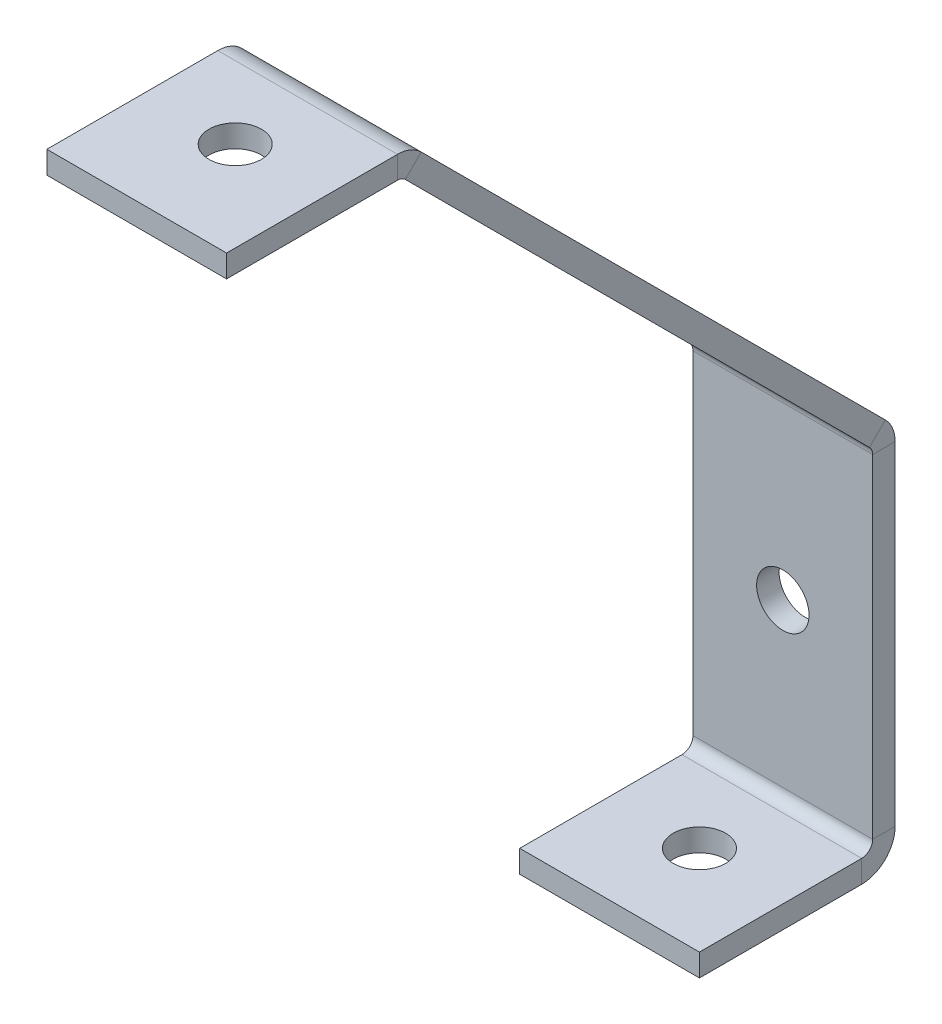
ISO-10303-21;
HEADER;
FILE_DESCRIPTION(('STEP AP214'),'2;1');
FILE_NAME('part.step','',(''),(''),'','','');
FILE_SCHEMA(('AUTOMOTIVE_DESIGN { 1 0 10303 214 1 1 1 1 }'));
ENDSEC;
DATA;
#1=APPLICATION_CONTEXT('core data for automotive mechanical design processes');
#2=APPLICATION_PROTOCOL_DEFINITION('international standard','automotive_design',2000,#1);
#3=PRODUCT_CONTEXT('',#1,'mechanical');
#4=PRODUCT('Part','Part','',(#3));
#5=PRODUCT_RELATED_PRODUCT_CATEGORY('part','',(#4));
#6=PRODUCT_DEFINITION_FORMATION('','',#4);
#7=PRODUCT_DEFINITION_CONTEXT('part definition',#1,'design');
#8=PRODUCT_DEFINITION('design','',#6,#7);
#9=PRODUCT_DEFINITION_SHAPE('','',#8);
#10=(LENGTH_UNIT() NAMED_UNIT(*) SI_UNIT(.MILLI.,.METRE.));
#11=(NAMED_UNIT(*) PLANE_ANGLE_UNIT() SI_UNIT($,.RADIAN.));
#12=(NAMED_UNIT(*) SI_UNIT($,.STERADIAN.) SOLID_ANGLE_UNIT());
#13=UNCERTAINTY_MEASURE_WITH_UNIT(LENGTH_MEASURE(1.E-05),#10,'distance_accuracy_value','');
#14=(GEOMETRIC_REPRESENTATION_CONTEXT(3) GLOBAL_UNCERTAINTY_ASSIGNED_CONTEXT((#13)) GLOBAL_UNIT_ASSIGNED_CONTEXT((#10,
#11,#12)) REPRESENTATION_CONTEXT('',''));
#15=CARTESIAN_POINT('',(0.,0.,0.));
#16=DIRECTION('',(0.,0.,1.));
#17=DIRECTION('',(1.,0.,0.));
#18=AXIS2_PLACEMENT_3D('',#15,#16,#17);
#19=CARTESIAN_POINT('',(12.,-10.9309729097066,-11.5690270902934));
#20=DIRECTION('',(-1.,0.,0.));
#21=DIRECTION('',(0.,-1.,0.));
#22=AXIS2_PLACEMENT_3D('',#19,#20,#21);
#23=PLANE('',#22);
#24=DIRECTION('',(0.,1.,0.));
#25=VECTOR('',#24,1.);
#26=CARTESIAN_POINT('',(12.,-10.9309729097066,-11.5690270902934));
#27=LINE('',#26,#25);
#28=CARTESIAN_POINT('',(12.,2.2366,-11.5690271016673));
#29=VERTEX_POINT('',#28);
#30=CARTESIAN_POINT('',(12.,24.48524063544,-11.5690270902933));
#31=VERTEX_POINT('',#30);
#32=EDGE_CURVE('E199',#29,#31,#27,.T.);
#33=ORIENTED_EDGE('',*,*,#32,.F.);
#34=DIRECTION('',(0.,0.,-1.));
#35=VECTOR('',#34,1.);
#36=CARTESIAN_POINT('',(12.,2.23660000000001,-11.5690270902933));
#37=LINE('',#36,#35);
#38=CARTESIAN_POINT('',(12.,2.23660000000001,-13.0690270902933));
#39=VERTEX_POINT('',#38);
#40=EDGE_CURVE('E14',#29,#39,#37,.T.);
#41=ORIENTED_EDGE('',*,*,#40,.T.);
#42=DIRECTION('',(0.,1.,0.));
#43=VECTOR('',#42,1.);
#44=CARTESIAN_POINT('',(12.,-10.9309729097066,-13.0690270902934));
#45=LINE('',#44,#43);
#46=CARTESIAN_POINT('',(12.,24.48524063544,-13.0690270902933));
#47=VERTEX_POINT('',#46);
#48=EDGE_CURVE('E204',#39,#47,#45,.T.);
#49=ORIENTED_EDGE('',*,*,#48,.T.);
#50=DIRECTION('',(0.,0.,-1.));
#51=VECTOR('',#50,1.);
#52=CARTESIAN_POINT('',(12.,24.48524063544,-11.5690270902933));
#53=LINE('',#52,#51);
#54=EDGE_CURVE('E221',#31,#47,#53,.T.);
#55=ORIENTED_EDGE('',*,*,#54,.F.);
#56=EDGE_LOOP('',(#33,#41,#49,#55));
#57=FACE_BOUND('',#56,.T.);
#58=ADVANCED_FACE('F56',(#57),#23,.F.);
#59=CARTESIAN_POINT('',(0.,-10.9309729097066,-11.5690270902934));
#60=DIRECTION('',(1.,0.,0.));
#61=DIRECTION('',(0.,1.,0.));
#62=AXIS2_PLACEMENT_3D('',#59,#60,#61);
#63=PLANE('',#62);
#64=DIRECTION('',(0.,-1.,0.));
#65=VECTOR('',#64,1.);
#66=CARTESIAN_POINT('',(0.,-10.9309729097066,-13.0690270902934));
#67=LINE('',#66,#65);
#68=CARTESIAN_POINT('',(0.,24.48524063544,-13.0690270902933));
#69=VERTEX_POINT('',#68);
#70=CARTESIAN_POINT('',(0.,2.23660000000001,-13.069027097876));
#71=VERTEX_POINT('',#70);
#72=EDGE_CURVE('E191',#69,#71,#67,.T.);
#73=ORIENTED_EDGE('',*,*,#72,.T.);
#74=DIRECTION('',(0.,0.,1.));
#75=VECTOR('',#74,1.);
#76=CARTESIAN_POINT('',(0.,2.23660000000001,-11.5690270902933));
#77=LINE('',#76,#75);
#78=CARTESIAN_POINT('',(0.,2.2366,-11.5690271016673));
#79=VERTEX_POINT('',#78);
#80=EDGE_CURVE('E173',#71,#79,#77,.T.);
#81=ORIENTED_EDGE('',*,*,#80,.T.);
#82=DIRECTION('',(0.,-1.,0.));
#83=VECTOR('',#82,1.);
#84=CARTESIAN_POINT('',(0.,-10.9309729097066,-11.5690270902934));
#85=LINE('',#84,#83);
#86=CARTESIAN_POINT('',(0.,24.48524063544,-11.5690271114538));
#87=VERTEX_POINT('',#86);
#88=EDGE_CURVE('E59',#87,#79,#85,.T.);
#89=ORIENTED_EDGE('',*,*,#88,.F.);
#90=DIRECTION('',(0.,0.,1.));
#91=VECTOR('',#90,1.);
#92=CARTESIAN_POINT('',(0.,24.48524063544,-11.5690270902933));
#93=LINE('',#92,#91);
#94=EDGE_CURVE('E194',#69,#87,#93,.T.);
#95=ORIENTED_EDGE('',*,*,#94,.F.);
#96=EDGE_LOOP('',(#73,#81,#89,#95));
#97=FACE_BOUND('',#96,.T.);
#98=ADVANCED_FACE('F192',(#97),#63,.F.);
#99=CARTESIAN_POINT('',(0.,82.0690270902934,-11.5690270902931));
#100=DIRECTION('',(0.,0.,-1.));
#101=DIRECTION('',(0.,1.,0.));
#102=AXIS2_PLACEMENT_3D('',#99,#100,#101);
#103=PLANE('',#102);
#104=CARTESIAN_POINT('',(6.,13.0690270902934,-11.5690270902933));
#105=DIRECTION('',(0.,0.,1.));
#106=DIRECTION('',(0.,-1.,0.));
#107=AXIS2_PLACEMENT_3D('',#104,#105,#106);
#108=CIRCLE('',#107,1.75);
#109=CARTESIAN_POINT('',(6.,11.3190270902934,-11.5690270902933));
#110=VERTEX_POINT('',#109);
#111=EDGE_CURVE('E216',#110,#110,#108,.T.);
#112=ORIENTED_EDGE('',*,*,#111,.F.);
#113=EDGE_LOOP('',(#112));
#114=FACE_BOUND('',#113,.T.);
#115=ORIENTED_EDGE('',*,*,#88,.T.);
#116=DIRECTION('',(1.,0.,0.));
#117=VECTOR('',#116,1.);
#118=CARTESIAN_POINT('',(0.,2.2366,-11.5690270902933));
#119=LINE('',#118,#117);
#120=EDGE_CURVE('E182',#79,#29,#119,.T.);
#121=ORIENTED_EDGE('',*,*,#120,.T.);
#122=ORIENTED_EDGE('',*,*,#32,.T.);
#123=DIRECTION('',(1.,0.,0.));
#124=VECTOR('',#123,1.);
#125=CARTESIAN_POINT('',(0.,24.48524063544,-11.5690270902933));
#126=LINE('',#125,#124);
#127=EDGE_CURVE('E228',#87,#31,#126,.T.);
#128=ORIENTED_EDGE('',*,*,#127,.F.);
#129=EDGE_LOOP('',(#115,#121,#122,#128));
#130=FACE_BOUND('',#129,.T.);
#131=ADVANCED_FACE('F310',(#114,#130),#103,.F.);
#132=CARTESIAN_POINT('',(12.,-0.862547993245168,-37.2219254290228));
#133=DIRECTION('',(-1.,0.,0.));
#134=DIRECTION('',(0.,-0.707106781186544,-0.707106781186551));
#135=AXIS2_PLACEMENT_3D('',#132,#133,#134);
#136=PLANE('',#135);
#137=DIRECTION('',(0.,0.707106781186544,0.707106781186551));
#138=VECTOR('',#137,1.);
#139=CARTESIAN_POINT('',(12.,-0.862547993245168,-37.2219254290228));
#140=LINE('',#139,#138);
#141=CARTESIAN_POINT('',(12.,25.0060955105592,-11.3532819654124));
#142=VERTEX_POINT('',#141);
#143=CARTESIAN_POINT('',(12.,56.0003019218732,19.6409244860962));
#144=VERTEX_POINT('',#143);
#145=EDGE_CURVE('E284',#142,#144,#140,.T.);
#146=ORIENTED_EDGE('',*,*,#145,.F.);
#147=DIRECTION('',(0.,0.707106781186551,-0.707106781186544));
#148=VECTOR('',#147,1.);
#149=CARTESIAN_POINT('',(12.,25.006095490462,-11.3532819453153));
#150=LINE('',#149,#148);
#151=CARTESIAN_POINT('',(12.,26.0667556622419,-12.4139421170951));
#152=VERTEX_POINT('',#151);
#153=EDGE_CURVE('E300',#142,#152,#150,.T.);
#154=ORIENTED_EDGE('',*,*,#153,.T.);
#155=DIRECTION('',(0.,0.707106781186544,0.707106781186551));
#156=VECTOR('',#155,1.);
#157=CARTESIAN_POINT('',(12.,0.198112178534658,-38.2825856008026));
#158=LINE('',#157,#156);
#159=CARTESIAN_POINT('',(12.,57.060962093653,18.5802643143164));
#160=VERTEX_POINT('',#159);
#161=EDGE_CURVE('E303',#152,#160,#158,.T.);
#162=ORIENTED_EDGE('',*,*,#161,.T.);
#163=DIRECTION('',(0.,0.707106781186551,-0.707106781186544));
#164=VECTOR('',#163,1.);
#165=CARTESIAN_POINT('',(12.,56.0003019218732,19.6409244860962));
#166=LINE('',#165,#164);
#167=EDGE_CURVE('E283',#144,#160,#166,.T.);
#168=ORIENTED_EDGE('',*,*,#167,.F.);
#169=EDGE_LOOP('',(#146,#154,#162,#168));
#170=FACE_BOUND('',#169,.T.);
#171=ADVANCED_FACE('F352',(#170),#136,.F.);
#172=CARTESIAN_POINT('',(0.,-0.862547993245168,-37.2219254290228));
#173=DIRECTION('',(1.,0.,0.));
#174=DIRECTION('',(0.,0.707106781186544,0.707106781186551));
#175=AXIS2_PLACEMENT_3D('',#172,#173,#174);
#176=PLANE('',#175);
#177=DIRECTION('',(0.,-0.707106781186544,-0.707106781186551));
#178=VECTOR('',#177,1.);
#179=CARTESIAN_POINT('',(0.,0.198112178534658,-38.2825856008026));
#180=LINE('',#179,#178);
#181=CARTESIAN_POINT('',(0.,57.060962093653,18.5802643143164));
#182=VERTEX_POINT('',#181);
#183=CARTESIAN_POINT('',(0.,26.0667556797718,-12.4139421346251));
#184=VERTEX_POINT('',#183);
#185=EDGE_CURVE('E279',#182,#184,#180,.T.);
#186=ORIENTED_EDGE('',*,*,#185,.T.);
#187=DIRECTION('',(0.,-0.707106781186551,0.707106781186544));
#188=VECTOR('',#187,1.);
#189=CARTESIAN_POINT('',(0.,25.006095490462,-11.3532819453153));
#190=LINE('',#189,#188);
#191=CARTESIAN_POINT('',(0.,25.0060955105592,-11.3532819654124));
#192=VERTEX_POINT('',#191);
#193=EDGE_CURVE('E296',#184,#192,#190,.T.);
#194=ORIENTED_EDGE('',*,*,#193,.T.);
#195=DIRECTION('',(0.,-0.707106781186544,-0.707106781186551));
#196=VECTOR('',#195,1.);
#197=CARTESIAN_POINT('',(0.,-0.862547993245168,-37.2219254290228));
#198=LINE('',#197,#196);
#199=CARTESIAN_POINT('',(0.,56.0003019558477,19.6409244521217));
#200=VERTEX_POINT('',#199);
#201=EDGE_CURVE('E305',#200,#192,#198,.T.);
#202=ORIENTED_EDGE('',*,*,#201,.F.);
#203=DIRECTION('',(0.,-0.707106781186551,0.707106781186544));
#204=VECTOR('',#203,1.);
#205=CARTESIAN_POINT('',(0.,56.0003019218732,19.6409244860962));
#206=LINE('',#205,#204);
#207=EDGE_CURVE('E290',#182,#200,#206,.T.);
#208=ORIENTED_EDGE('',*,*,#207,.F.);
#209=EDGE_LOOP('',(#186,#194,#202,#208));
#210=FACE_BOUND('',#209,.T.);
#211=ADVANCED_FACE('F358',(#210),#176,.F.);
#212=CARTESIAN_POINT('',(0.,64.8983826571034,28.5390052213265));
#213=DIRECTION('',(0.,0.707106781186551,-0.707106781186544));
#214=DIRECTION('',(0.,0.707106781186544,0.707106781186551));
#215=AXIS2_PLACEMENT_3D('',#212,#213,#214);
#216=PLANE('',#215);
#217=ORIENTED_EDGE('',*,*,#201,.T.);
#218=DIRECTION('',(1.,0.,0.));
#219=VECTOR('',#218,1.);
#220=CARTESIAN_POINT('',(0.,25.006095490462,-11.3532819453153));
#221=LINE('',#220,#219);
#222=EDGE_CURVE('E293',#192,#142,#221,.T.);
#223=ORIENTED_EDGE('',*,*,#222,.T.);
#224=ORIENTED_EDGE('',*,*,#145,.T.);
#225=DIRECTION('',(1.,0.,0.));
#226=VECTOR('',#225,1.);
#227=CARTESIAN_POINT('',(0.,56.0003019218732,19.6409244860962));
#228=LINE('',#227,#226);
#229=EDGE_CURVE('E280',#200,#144,#228,.T.);
#230=ORIENTED_EDGE('',*,*,#229,.F.);
#231=EDGE_LOOP('',(#217,#223,#224,#230));
#232=FACE_BOUND('',#231,.T.);
#233=ADVANCED_FACE('F364',(#232),#216,.F.);
#234=CARTESIAN_POINT('',(0.,65.9590428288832,27.4783450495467));
#235=DIRECTION('',(0.,0.707106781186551,-0.707106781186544));
#236=DIRECTION('',(0.,0.707106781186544,0.707106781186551));
#237=AXIS2_PLACEMENT_3D('',#234,#235,#236);
#238=PLANE('',#237);
#239=DIRECTION('',(1.,0.,0.));
#240=VECTOR('',#239,1.);
#241=CARTESIAN_POINT('',(0.,26.0667556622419,-12.4139421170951));
#242=LINE('',#241,#240);
#243=EDGE_CURVE('E79',#184,#152,#242,.T.);
#244=ORIENTED_EDGE('',*,*,#243,.F.);
#245=ORIENTED_EDGE('',*,*,#185,.F.);
#246=DIRECTION('',(1.,0.,0.));
#247=VECTOR('',#246,1.);
#248=CARTESIAN_POINT('',(0.,57.0609620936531,18.5802643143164));
#249=LINE('',#248,#247);
#250=EDGE_CURVE('E287',#182,#160,#249,.T.);
#251=ORIENTED_EDGE('',*,*,#250,.T.);
#252=ORIENTED_EDGE('',*,*,#161,.F.);
#253=EDGE_LOOP('',(#244,#245,#251,#252));
#254=FACE_BOUND('',#253,.T.);
#255=ADVANCED_FACE('F360',(#254),#238,.T.);
#256=CARTESIAN_POINT('',(0.,55.4794470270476,20.1617793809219));
#257=DIRECTION('',(1.,0.,0.));
#258=DIRECTION('',(0.,0.707106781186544,0.707106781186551));
#259=AXIS2_PLACEMENT_3D('',#256,#257,#258);
#260=PLANE('',#259);
#261=DIRECTION('',(0.,-1.,0.));
#262=VECTOR('',#261,1.);
#263=CARTESIAN_POINT('',(0.,56.2160470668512,20.1617793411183));
#264=LINE('',#263,#262);
#265=CARTESIAN_POINT('',(0.,57.7160470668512,20.1617793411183));
#266=VERTEX_POINT('',#265);
#267=CARTESIAN_POINT('',(0.,56.2160470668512,20.1617793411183));
#268=VERTEX_POINT('',#267);
#269=EDGE_CURVE('E236',#266,#268,#264,.T.);
#270=ORIENTED_EDGE('',*,*,#269,.F.);
#271=CARTESIAN_POINT('',(0.,55.4794470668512,20.1617793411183));
#272=DIRECTION('',(-1.,0.,0.));
#273=DIRECTION('',(0.,-0.707106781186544,-0.707106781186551));
#274=AXIS2_PLACEMENT_3D('',#271,#272,#273);
#275=CIRCLE('',#274,2.23660005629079);
#276=EDGE_CURVE('E235',#266,#182,#275,.T.);
#277=ORIENTED_EDGE('',*,*,#276,.T.);
#278=ORIENTED_EDGE('',*,*,#207,.T.);
#279=CARTESIAN_POINT('',(0.,55.4794470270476,20.1617793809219));
#280=DIRECTION('',(-1.,0.,0.));
#281=DIRECTION('',(0.,-0.707106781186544,-0.707106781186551));
#282=AXIS2_PLACEMENT_3D('',#279,#280,#281);
#283=CIRCLE('',#282,0.736600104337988);
#284=EDGE_CURVE('E271',#268,#200,#283,.T.);
#285=ORIENTED_EDGE('',*,*,#284,.F.);
#286=EDGE_LOOP('',(#270,#277,#278,#285));
#287=FACE_BOUND('',#286,.T.);
#288=ADVANCED_FACE('F363',(#287),#260,.F.);
#289=CARTESIAN_POINT('',(12.,55.4794470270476,20.1617793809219));
#290=DIRECTION('',(-1.,0.,0.));
#291=DIRECTION('',(0.,-0.707106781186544,-0.707106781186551));
#292=AXIS2_PLACEMENT_3D('',#289,#290,#291);
#293=PLANE('',#292);
#294=ORIENTED_EDGE('',*,*,#167,.T.);
#295=CARTESIAN_POINT('',(12.,55.4794470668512,20.1617793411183));
#296=DIRECTION('',(-1.,0.,0.));
#297=DIRECTION('',(0.,-0.707106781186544,-0.707106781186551));
#298=AXIS2_PLACEMENT_3D('',#295,#296,#297);
#299=CIRCLE('',#298,2.23660005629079);
#300=CARTESIAN_POINT('',(12.,57.7160470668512,20.1617793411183));
#301=VERTEX_POINT('',#300);
#302=EDGE_CURVE('E268',#160,#301,#299,.F.);
#303=ORIENTED_EDGE('',*,*,#302,.T.);
#304=DIRECTION('',(0.,1.,0.));
#305=VECTOR('',#304,1.);
#306=CARTESIAN_POINT('',(12.,56.2160470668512,20.1617793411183));
#307=LINE('',#306,#305);
#308=CARTESIAN_POINT('',(12.,56.2160471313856,20.1617793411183));
#309=VERTEX_POINT('',#308);
#310=EDGE_CURVE('E246',#309,#301,#307,.T.);
#311=ORIENTED_EDGE('',*,*,#310,.F.);
#312=CARTESIAN_POINT('',(12.,55.4794470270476,20.1617793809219));
#313=DIRECTION('',(1.,0.,0.));
#314=DIRECTION('',(0.,0.707106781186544,0.707106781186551));
#315=AXIS2_PLACEMENT_3D('',#312,#313,#314);
#316=CIRCLE('',#315,0.736600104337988);
#317=EDGE_CURVE('E276',#144,#309,#316,.T.);
#318=ORIENTED_EDGE('',*,*,#317,.F.);
#319=EDGE_LOOP('',(#294,#303,#311,#318));
#320=FACE_BOUND('',#319,.T.);
#321=ADVANCED_FACE('F374',(#320),#293,.F.);
#322=CARTESIAN_POINT('',(18.1496183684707,55.4794470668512,20.1617793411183));
#323=DIRECTION('',(-1.,0.,0.));
#324=DIRECTION('',(0.,-0.707106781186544,-0.707106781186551));
#325=AXIS2_PLACEMENT_3D('',#322,#323,#324);
#326=CYLINDRICAL_SURFACE('',#325,0.73660005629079);
#327=ORIENTED_EDGE('',*,*,#317,.T.);
#328=DIRECTION('',(1.,0.,0.));
#329=VECTOR('',#328,1.);
#330=CARTESIAN_POINT('',(0.,56.2160470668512,20.1617793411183));
#331=LINE('',#330,#329);
#332=EDGE_CURVE('E253',#268,#309,#331,.T.);
#333=ORIENTED_EDGE('',*,*,#332,.F.);
#334=ORIENTED_EDGE('',*,*,#284,.T.);
#335=ORIENTED_EDGE('',*,*,#229,.T.);
#336=EDGE_LOOP('',(#327,#333,#334,#335));
#337=FACE_BOUND('',#336,.T.);
#338=ADVANCED_FACE('F378',(#337),#326,.F.);
#339=CARTESIAN_POINT('',(18.1496183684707,55.4794470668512,20.1617793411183));
#340=DIRECTION('',(-1.,0.,0.));
#341=DIRECTION('',(0.,-0.707106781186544,-0.707106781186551));
#342=AXIS2_PLACEMENT_3D('',#339,#340,#341);
#343=CYLINDRICAL_SURFACE('',#342,2.23660005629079);
#344=ORIENTED_EDGE('',*,*,#302,.F.);
#345=ORIENTED_EDGE('',*,*,#250,.F.);
#346=ORIENTED_EDGE('',*,*,#276,.F.);
#347=DIRECTION('',(1.,0.,0.));
#348=VECTOR('',#347,1.);
#349=CARTESIAN_POINT('',(0.,57.7160470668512,20.1617793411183));
#350=LINE('',#349,#348);
#351=EDGE_CURVE('E208',#266,#301,#350,.T.);
#352=ORIENTED_EDGE('',*,*,#351,.T.);
#353=EDGE_LOOP('',(#344,#345,#346,#352));
#354=FACE_BOUND('',#353,.T.);
#355=ADVANCED_FACE('F382',(#354),#343,.T.);
#356=CARTESIAN_POINT('',(0.,56.2160470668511,31.577992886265));
#357=DIRECTION('',(0.,0.,-1.));
#358=DIRECTION('',(1.,0.,0.));
#359=AXIS2_PLACEMENT_3D('',#356,#357,#358);
#360=PLANE('',#359);
#361=DIRECTION('',(-1.,0.,0.));
#362=VECTOR('',#361,1.);
#363=CARTESIAN_POINT('',(0.,57.7160470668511,31.577992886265));
#364=LINE('',#363,#362);
#365=CARTESIAN_POINT('',(12.,57.7160470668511,31.577992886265));
#366=VERTEX_POINT('',#365);
#367=CARTESIAN_POINT('',(0.,57.7160470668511,31.577992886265));
#368=VERTEX_POINT('',#367);
#369=EDGE_CURVE('E264',#366,#368,#364,.T.);
#370=ORIENTED_EDGE('',*,*,#369,.T.);
#371=DIRECTION('',(0.,1.,0.));
#372=VECTOR('',#371,1.);
#373=CARTESIAN_POINT('',(0.,56.2160470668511,31.577992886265));
#374=LINE('',#373,#372);
#375=CARTESIAN_POINT('',(0.,56.2160470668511,31.577992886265));
#376=VERTEX_POINT('',#375);
#377=EDGE_CURVE('E232',#376,#368,#374,.T.);
#378=ORIENTED_EDGE('',*,*,#377,.F.);
#379=DIRECTION('',(-1.,0.,0.));
#380=VECTOR('',#379,1.);
#381=CARTESIAN_POINT('',(0.,56.2160470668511,31.577992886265));
#382=LINE('',#381,#380);
#383=CARTESIAN_POINT('',(12.,56.2160470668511,31.577992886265));
#384=VERTEX_POINT('',#383);
#385=EDGE_CURVE('E249',#384,#376,#382,.T.);
#386=ORIENTED_EDGE('',*,*,#385,.F.);
#387=DIRECTION('',(0.,1.,0.));
#388=VECTOR('',#387,1.);
#389=CARTESIAN_POINT('',(12.,56.2160470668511,31.577992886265));
#390=LINE('',#389,#388);
#391=EDGE_CURVE('E261',#384,#366,#390,.T.);
#392=ORIENTED_EDGE('',*,*,#391,.T.);
#393=EDGE_LOOP('',(#370,#378,#386,#392));
#394=FACE_BOUND('',#393,.T.);
#395=ADVANCED_FACE('F385',(#394),#360,.F.);
#396=CARTESIAN_POINT('',(5.99999999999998,56.2160470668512,24.9999453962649));
#397=DIRECTION('',(0.,1.,0.));
#398=DIRECTION('',(0.,0.,1.));
#399=AXIS2_PLACEMENT_3D('',#396,#397,#398);
#400=CYLINDRICAL_SURFACE('',#399,1.75);
#401=CARTESIAN_POINT('',(5.99999999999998,56.2160470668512,24.9999453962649));
#402=DIRECTION('',(0.,-1.,0.));
#403=DIRECTION('',(0.,0.,-1.));
#404=AXIS2_PLACEMENT_3D('',#401,#402,#403);
#405=CIRCLE('',#404,1.75);
#406=CARTESIAN_POINT('',(5.99999999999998,56.2160470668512,23.2499453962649));
#407=VERTEX_POINT('',#406);
#408=EDGE_CURVE('E258',#407,#407,#405,.T.);
#409=ORIENTED_EDGE('',*,*,#408,.T.);
#410=EDGE_LOOP('',(#409));
#411=FACE_BOUND('',#410,.T.);
#412=CARTESIAN_POINT('',(5.99999999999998,57.7160470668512,24.999945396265));
#413=DIRECTION('',(0.,-1.,0.));
#414=DIRECTION('',(0.,0.,-1.));
#415=AXIS2_PLACEMENT_3D('',#412,#413,#414);
#416=CIRCLE('',#415,1.75);
#417=CARTESIAN_POINT('',(5.99999999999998,57.7160470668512,23.249945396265));
#418=VERTEX_POINT('',#417);
#419=EDGE_CURVE('E241',#418,#418,#416,.T.);
#420=ORIENTED_EDGE('',*,*,#419,.F.);
#421=EDGE_LOOP('',(#420));
#422=FACE_BOUND('',#421,.T.);
#423=ADVANCED_FACE('F398',(#411,#422),#400,.F.);
#424=CARTESIAN_POINT('',(0.,56.2160470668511,31.577992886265));
#425=DIRECTION('',(0.,1.,0.));
#426=DIRECTION('',(0.,0.,1.));
#427=AXIS2_PLACEMENT_3D('',#424,#425,#426);
#428=PLANE('',#427);
#429=ORIENTED_EDGE('',*,*,#408,.F.);
#430=EDGE_LOOP('',(#429));
#431=FACE_BOUND('',#430,.T.);
#432=DIRECTION('',(0.,0.,-1.));
#433=VECTOR('',#432,1.);
#434=CARTESIAN_POINT('',(0.,56.2160470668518,-61.422007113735));
#435=LINE('',#434,#433);
#436=EDGE_CURVE('E256',#376,#268,#435,.T.);
#437=ORIENTED_EDGE('',*,*,#436,.T.);
#438=ORIENTED_EDGE('',*,*,#332,.T.);
#439=DIRECTION('',(0.,0.,1.));
#440=VECTOR('',#439,1.);
#441=CARTESIAN_POINT('',(12.,56.2160470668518,-61.422007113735));
#442=LINE('',#441,#440);
#443=EDGE_CURVE('E251',#309,#384,#442,.T.);
#444=ORIENTED_EDGE('',*,*,#443,.T.);
#445=ORIENTED_EDGE('',*,*,#385,.T.);
#446=EDGE_LOOP('',(#437,#438,#444,#445));
#447=FACE_BOUND('',#446,.T.);
#448=ADVANCED_FACE('F394',(#431,#447),#428,.F.);
#449=CARTESIAN_POINT('',(12.,56.2160470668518,-61.422007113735));
#450=DIRECTION('',(-1.,0.,0.));
#451=DIRECTION('',(0.,0.,-1.));
#452=AXIS2_PLACEMENT_3D('',#449,#450,#451);
#453=PLANE('',#452);
#454=ORIENTED_EDGE('',*,*,#443,.F.);
#455=ORIENTED_EDGE('',*,*,#310,.T.);
#456=DIRECTION('',(0.,0.,1.));
#457=VECTOR('',#456,1.);
#458=CARTESIAN_POINT('',(12.,57.7160470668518,-61.422007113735));
#459=LINE('',#458,#457);
#460=EDGE_CURVE('E244',#301,#366,#459,.T.);
#461=ORIENTED_EDGE('',*,*,#460,.T.);
#462=ORIENTED_EDGE('',*,*,#391,.F.);
#463=EDGE_LOOP('',(#454,#455,#461,#462));
#464=FACE_BOUND('',#463,.T.);
#465=ADVANCED_FACE('F390',(#464),#453,.F.);
#466=CARTESIAN_POINT('',(0.,57.7160470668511,31.577992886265));
#467=DIRECTION('',(0.,1.,0.));
#468=DIRECTION('',(0.,0.,1.));
#469=AXIS2_PLACEMENT_3D('',#466,#467,#468);
#470=PLANE('',#469);
#471=ORIENTED_EDGE('',*,*,#351,.F.);
#472=DIRECTION('',(0.,0.,-1.));
#473=VECTOR('',#472,1.);
#474=CARTESIAN_POINT('',(0.,57.7160470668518,-61.422007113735));
#475=LINE('',#474,#473);
#476=EDGE_CURVE('E239',#368,#266,#475,.T.);
#477=ORIENTED_EDGE('',*,*,#476,.F.);
#478=ORIENTED_EDGE('',*,*,#369,.F.);
#479=ORIENTED_EDGE('',*,*,#460,.F.);
#480=EDGE_LOOP('',(#471,#477,#478,#479));
#481=FACE_BOUND('',#480,.T.);
#482=ORIENTED_EDGE('',*,*,#419,.T.);
#483=EDGE_LOOP('',(#482));
#484=FACE_BOUND('',#483,.T.);
#485=ADVANCED_FACE('F339',(#481,#484),#470,.T.);
#486=CARTESIAN_POINT('',(0.,56.2160470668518,-61.422007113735));
#487=DIRECTION('',(1.,0.,0.));
#488=DIRECTION('',(0.,0.,1.));
#489=AXIS2_PLACEMENT_3D('',#486,#487,#488);
#490=PLANE('',#489);
#491=ORIENTED_EDGE('',*,*,#476,.T.);
#492=ORIENTED_EDGE('',*,*,#269,.T.);
#493=ORIENTED_EDGE('',*,*,#436,.F.);
#494=ORIENTED_EDGE('',*,*,#377,.T.);
#495=EDGE_LOOP('',(#491,#492,#493,#494));
#496=FACE_BOUND('',#495,.T.);
#497=ADVANCED_FACE('F332',(#496),#490,.F.);
#498=CARTESIAN_POINT('',(6.,13.0690270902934,-11.5690270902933));
#499=DIRECTION('',(0.,0.,-1.));
#500=DIRECTION('',(0.,1.,0.));
#501=AXIS2_PLACEMENT_3D('',#498,#499,#500);
#502=CYLINDRICAL_SURFACE('',#501,1.75);
#503=ORIENTED_EDGE('',*,*,#111,.T.);
#504=EDGE_LOOP('',(#503));
#505=FACE_BOUND('',#504,.T.);
#506=CARTESIAN_POINT('',(6.,13.0690270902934,-13.0690270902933));
#507=DIRECTION('',(0.,0.,1.));
#508=DIRECTION('',(0.,-1.,0.));
#509=AXIS2_PLACEMENT_3D('',#506,#507,#508);
#510=CIRCLE('',#509,1.75);
#511=CARTESIAN_POINT('',(6.,11.3190270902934,-13.0690270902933));
#512=VERTEX_POINT('',#511);
#513=EDGE_CURVE('E198',#512,#512,#510,.T.);
#514=ORIENTED_EDGE('',*,*,#513,.F.);
#515=EDGE_LOOP('',(#514));
#516=FACE_BOUND('',#515,.T.);
#517=ADVANCED_FACE('F330',(#505,#516),#502,.F.);
#518=CARTESIAN_POINT('',(0.,82.0690270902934,-13.0690270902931));
#519=DIRECTION('',(0.,0.,-1.));
#520=DIRECTION('',(0.,1.,0.));
#521=AXIS2_PLACEMENT_3D('',#518,#519,#520);
#522=PLANE('',#521);
#523=DIRECTION('',(1.,0.,0.));
#524=VECTOR('',#523,1.);
#525=CARTESIAN_POINT('',(0.,2.23660000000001,-13.0690270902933));
#526=LINE('',#525,#524);
#527=EDGE_CURVE('E64',#71,#39,#526,.T.);
#528=ORIENTED_EDGE('',*,*,#527,.F.);
#529=ORIENTED_EDGE('',*,*,#72,.F.);
#530=DIRECTION('',(1.,0.,0.));
#531=VECTOR('',#530,1.);
#532=CARTESIAN_POINT('',(0.,24.48524063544,-13.0690270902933));
#533=LINE('',#532,#531);
#534=EDGE_CURVE('E209',#69,#47,#533,.T.);
#535=ORIENTED_EDGE('',*,*,#534,.T.);
#536=ORIENTED_EDGE('',*,*,#48,.F.);
#537=EDGE_LOOP('',(#528,#529,#535,#536));
#538=FACE_BOUND('',#537,.T.);
#539=ORIENTED_EDGE('',*,*,#513,.T.);
#540=EDGE_LOOP('',(#539));
#541=FACE_BOUND('',#540,.T.);
#542=ADVANCED_FACE('F202',(#538,#541),#522,.T.);
#543=CARTESIAN_POINT('',(0.,24.48524063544,-10.8324270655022));
#544=DIRECTION('',(1.,0.,0.));
#545=DIRECTION('',(0.,1.,0.));
#546=AXIS2_PLACEMENT_3D('',#543,#544,#545);
#547=PLANE('',#546);
#548=ORIENTED_EDGE('',*,*,#193,.F.);
#549=CARTESIAN_POINT('',(0.,24.48524063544,-10.8324270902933));
#550=DIRECTION('',(-1.,0.,0.));
#551=DIRECTION('',(0.,-1.,0.));
#552=AXIS2_PLACEMENT_3D('',#549,#550,#551);
#553=CIRCLE('',#552,2.2366000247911);
#554=EDGE_CURVE('E429',#184,#69,#553,.T.);
#555=ORIENTED_EDGE('',*,*,#554,.T.);
#556=ORIENTED_EDGE('',*,*,#94,.T.);
#557=CARTESIAN_POINT('',(0.,24.48524063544,-10.8324270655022));
#558=DIRECTION('',(-1.,0.,0.));
#559=DIRECTION('',(0.,-1.,0.));
#560=AXIS2_PLACEMENT_3D('',#557,#558,#559);
#561=CIRCLE('',#560,0.736600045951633);
#562=EDGE_CURVE('E321',#192,#87,#561,.T.);
#563=ORIENTED_EDGE('',*,*,#562,.F.);
#564=EDGE_LOOP('',(#548,#555,#556,#563));
#565=FACE_BOUND('',#564,.T.);
#566=ADVANCED_FACE('F338',(#565),#547,.F.);
#567=CARTESIAN_POINT('',(12.,24.48524063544,-10.8324270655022));
#568=DIRECTION('',(-1.,0.,0.));
#569=DIRECTION('',(0.,-1.,0.));
#570=AXIS2_PLACEMENT_3D('',#567,#568,#569);
#571=PLANE('',#570);
#572=ORIENTED_EDGE('',*,*,#54,.T.);
#573=CARTESIAN_POINT('',(12.,24.48524063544,-10.8324270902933));
#574=DIRECTION('',(-1.,0.,0.));
#575=DIRECTION('',(0.,-1.,0.));
#576=AXIS2_PLACEMENT_3D('',#573,#574,#575);
#577=CIRCLE('',#576,2.2366000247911);
#578=EDGE_CURVE('E324',#47,#152,#577,.F.);
#579=ORIENTED_EDGE('',*,*,#578,.T.);
#580=ORIENTED_EDGE('',*,*,#153,.F.);
#581=CARTESIAN_POINT('',(12.,24.48524063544,-10.8324270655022));
#582=DIRECTION('',(1.,0.,0.));
#583=DIRECTION('',(0.,1.,0.));
#584=AXIS2_PLACEMENT_3D('',#581,#582,#583);
#585=CIRCLE('',#584,0.736600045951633);
#586=EDGE_CURVE('E231',#31,#142,#585,.T.);
#587=ORIENTED_EDGE('',*,*,#586,.F.);
#588=EDGE_LOOP('',(#572,#579,#580,#587));
#589=FACE_BOUND('',#588,.T.);
#590=ADVANCED_FACE('F322',(#589),#571,.F.);
#591=CARTESIAN_POINT('',(18.1496183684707,24.48524063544,-10.8324270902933));
#592=DIRECTION('',(-1.,0.,0.));
#593=DIRECTION('',(0.,-1.,0.));
#594=AXIS2_PLACEMENT_3D('',#591,#592,#593);
#595=CYLINDRICAL_SURFACE('',#594,0.736600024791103);
#596=ORIENTED_EDGE('',*,*,#586,.T.);
#597=ORIENTED_EDGE('',*,*,#222,.F.);
#598=ORIENTED_EDGE('',*,*,#562,.T.);
#599=ORIENTED_EDGE('',*,*,#127,.T.);
#600=EDGE_LOOP('',(#596,#597,#598,#599));
#601=FACE_BOUND('',#600,.T.);
#602=ADVANCED_FACE('F319',(#601),#595,.F.);
#603=CARTESIAN_POINT('',(18.1496183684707,24.48524063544,-10.8324270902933));
#604=DIRECTION('',(-1.,0.,0.));
#605=DIRECTION('',(0.,-1.,0.));
#606=AXIS2_PLACEMENT_3D('',#603,#604,#605);
#607=CYLINDRICAL_SURFACE('',#606,2.2366000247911);
#608=ORIENTED_EDGE('',*,*,#578,.F.);
#609=ORIENTED_EDGE('',*,*,#534,.F.);
#610=ORIENTED_EDGE('',*,*,#554,.F.);
#611=ORIENTED_EDGE('',*,*,#243,.T.);
#612=EDGE_LOOP('',(#608,#609,#610,#611));
#613=FACE_BOUND('',#612,.T.);
#614=ADVANCED_FACE('F430',(#613),#607,.T.);
#615=CARTESIAN_POINT('',(6.,1.5,-6.));
#616=DIRECTION('',(0.,-1.,0.));
#617=DIRECTION('',(0.,0.,-1.));
#618=AXIS2_PLACEMENT_3D('',#615,#616,#617);
#619=CYLINDRICAL_SURFACE('',#618,1.75);
#620=CARTESIAN_POINT('',(6.,1.5,-6.));
#621=DIRECTION('',(0.,1.,0.));
#622=DIRECTION('',(0.,0.,1.));
#623=AXIS2_PLACEMENT_3D('',#620,#621,#622);
#624=CIRCLE('',#623,1.75);
#625=CARTESIAN_POINT('',(6.,1.5,-4.25));
#626=VERTEX_POINT('',#625);
#627=EDGE_CURVE('E445',#626,#626,#624,.T.);
#628=ORIENTED_EDGE('',*,*,#627,.T.);
#629=EDGE_LOOP('',(#628));
#630=FACE_BOUND('',#629,.T.);
#631=CARTESIAN_POINT('',(6.,0.,-6.));
#632=DIRECTION('',(0.,1.,0.));
#633=DIRECTION('',(0.,0.,1.));
#634=AXIS2_PLACEMENT_3D('',#631,#632,#633);
#635=CIRCLE('',#634,1.75);
#636=CARTESIAN_POINT('',(6.,0.,-4.25));
#637=VERTEX_POINT('',#636);
#638=EDGE_CURVE('E461',#637,#637,#635,.T.);
#639=ORIENTED_EDGE('',*,*,#638,.F.);
#640=EDGE_LOOP('',(#639));
#641=FACE_BOUND('',#640,.T.);
#642=ADVANCED_FACE('F506',(#630,#641),#619,.F.);
#643=CARTESIAN_POINT('',(0.,1.5,0.));
#644=DIRECTION('',(0.,0.,-1.));
#645=DIRECTION('',(-1.,0.,0.));
#646=AXIS2_PLACEMENT_3D('',#643,#644,#645);
#647=PLANE('',#646);
#648=DIRECTION('',(1.,0.,0.));
#649=VECTOR('',#648,1.);
#650=CARTESIAN_POINT('',(0.,0.,0.));
#651=LINE('',#650,#649);
#652=CARTESIAN_POINT('',(0.,0.,0.));
#653=VERTEX_POINT('',#652);
#654=CARTESIAN_POINT('',(12.,0.,0.));
#655=VERTEX_POINT('',#654);
#656=EDGE_CURVE('E448',#653,#655,#651,.T.);
#657=ORIENTED_EDGE('',*,*,#656,.T.);
#658=DIRECTION('',(0.,-1.,0.));
#659=VECTOR('',#658,1.);
#660=CARTESIAN_POINT('',(12.,1.5,0.));
#661=LINE('',#660,#659);
#662=CARTESIAN_POINT('',(12.,1.5,0.));
#663=VERTEX_POINT('',#662);
#664=EDGE_CURVE('E433',#663,#655,#661,.T.);
#665=ORIENTED_EDGE('',*,*,#664,.F.);
#666=DIRECTION('',(1.,0.,0.));
#667=VECTOR('',#666,1.);
#668=CARTESIAN_POINT('',(0.,1.5,0.));
#669=LINE('',#668,#667);
#670=CARTESIAN_POINT('',(0.,1.5,0.));
#671=VERTEX_POINT('',#670);
#672=EDGE_CURVE('E455',#671,#663,#669,.T.);
#673=ORIENTED_EDGE('',*,*,#672,.F.);
#674=DIRECTION('',(0.,-1.,0.));
#675=VECTOR('',#674,1.);
#676=CARTESIAN_POINT('',(0.,1.5,0.));
#677=LINE('',#676,#675);
#678=EDGE_CURVE('E450',#671,#653,#677,.T.);
#679=ORIENTED_EDGE('',*,*,#678,.T.);
#680=EDGE_LOOP('',(#657,#665,#673,#679));
#681=FACE_BOUND('',#680,.T.);
#682=ADVANCED_FACE('F489',(#681),#647,.F.);
#683=CARTESIAN_POINT('',(0.,1.5,-93.));
#684=DIRECTION('',(0.,-1.,0.));
#685=DIRECTION('',(0.,0.,-1.));
#686=AXIS2_PLACEMENT_3D('',#683,#684,#685);
#687=PLANE('',#686);
#688=DIRECTION('',(1.,0.,0.));
#689=VECTOR('',#688,1.);
#690=CARTESIAN_POINT('',(0.,1.5,-10.8324270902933));
#691=LINE('',#690,#689);
#692=CARTESIAN_POINT('',(0.,1.49999999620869,-10.8324270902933));
#693=VERTEX_POINT('',#692);
#694=CARTESIAN_POINT('',(12.,1.5,-10.8324270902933));
#695=VERTEX_POINT('',#694);
#696=EDGE_CURVE('E436',#693,#695,#691,.T.);
#697=ORIENTED_EDGE('',*,*,#696,.F.);
#698=DIRECTION('',(0.,0.,1.));
#699=VECTOR('',#698,1.);
#700=CARTESIAN_POINT('',(0.,1.5,0.));
#701=LINE('',#700,#699);
#702=EDGE_CURVE('E453',#693,#671,#701,.T.);
#703=ORIENTED_EDGE('',*,*,#702,.T.);
#704=ORIENTED_EDGE('',*,*,#672,.T.);
#705=DIRECTION('',(0.,0.,-1.));
#706=VECTOR('',#705,1.);
#707=CARTESIAN_POINT('',(12.,1.5,0.));
#708=LINE('',#707,#706);
#709=EDGE_CURVE('E457',#663,#695,#708,.T.);
#710=ORIENTED_EDGE('',*,*,#709,.T.);
#711=EDGE_LOOP('',(#697,#703,#704,#710));
#712=FACE_BOUND('',#711,.T.);
#713=ORIENTED_EDGE('',*,*,#627,.F.);
#714=EDGE_LOOP('',(#713));
#715=FACE_BOUND('',#714,.T.);
#716=ADVANCED_FACE('F480',(#712,#715),#687,.F.);
#717=CARTESIAN_POINT('',(0.,1.5,0.));
#718=DIRECTION('',(1.,0.,0.));
#719=DIRECTION('',(0.,0.,-1.));
#720=AXIS2_PLACEMENT_3D('',#717,#718,#719);
#721=PLANE('',#720);
#722=DIRECTION('',(0.,1.,0.));
#723=VECTOR('',#722,1.);
#724=CARTESIAN_POINT('',(0.,1.5,-10.8324270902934));
#725=LINE('',#724,#723);
#726=CARTESIAN_POINT('',(0.,0.,-10.8324270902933));
#727=VERTEX_POINT('',#726);
#728=EDGE_CURVE('E443',#727,#693,#725,.T.);
#729=ORIENTED_EDGE('',*,*,#728,.F.);
#730=DIRECTION('',(0.,0.,1.));
#731=VECTOR('',#730,1.);
#732=CARTESIAN_POINT('',(0.,0.,0.));
#733=LINE('',#732,#731);
#734=EDGE_CURVE('E459',#727,#653,#733,.T.);
#735=ORIENTED_EDGE('',*,*,#734,.T.);
#736=ORIENTED_EDGE('',*,*,#678,.F.);
#737=ORIENTED_EDGE('',*,*,#702,.F.);
#738=EDGE_LOOP('',(#729,#735,#736,#737));
#739=FACE_BOUND('',#738,.T.);
#740=ADVANCED_FACE('F485',(#739),#721,.F.);
#741=CARTESIAN_POINT('',(0.,0.,-93.));
#742=DIRECTION('',(0.,-1.,0.));
#743=DIRECTION('',(0.,0.,-1.));
#744=AXIS2_PLACEMENT_3D('',#741,#742,#743);
#745=PLANE('',#744);
#746=ORIENTED_EDGE('',*,*,#638,.T.);
#747=EDGE_LOOP('',(#746));
#748=FACE_BOUND('',#747,.T.);
#749=ORIENTED_EDGE('',*,*,#734,.F.);
#750=DIRECTION('',(1.,0.,0.));
#751=VECTOR('',#750,1.);
#752=CARTESIAN_POINT('',(0.,0.,-10.8324270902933));
#753=LINE('',#752,#751);
#754=CARTESIAN_POINT('',(12.,0.,-10.8324270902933));
#755=VERTEX_POINT('',#754);
#756=EDGE_CURVE('E187',#727,#755,#753,.T.);
#757=ORIENTED_EDGE('',*,*,#756,.T.);
#758=DIRECTION('',(0.,0.,-1.));
#759=VECTOR('',#758,1.);
#760=CARTESIAN_POINT('',(12.,0.,0.));
#761=LINE('',#760,#759);
#762=EDGE_CURVE('E431',#655,#755,#761,.T.);
#763=ORIENTED_EDGE('',*,*,#762,.F.);
#764=ORIENTED_EDGE('',*,*,#656,.F.);
#765=EDGE_LOOP('',(#749,#757,#763,#764));
#766=FACE_BOUND('',#765,.T.);
#767=ADVANCED_FACE('F492',(#748,#766),#745,.T.);
#768=CARTESIAN_POINT('',(12.,1.5,0.));
#769=DIRECTION('',(-1.,0.,0.));
#770=DIRECTION('',(0.,0.,1.));
#771=AXIS2_PLACEMENT_3D('',#768,#769,#770);
#772=PLANE('',#771);
#773=DIRECTION('',(0.,-1.,0.));
#774=VECTOR('',#773,1.);
#775=CARTESIAN_POINT('',(12.,1.5,-10.8324270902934));
#776=LINE('',#775,#774);
#777=EDGE_CURVE('E439',#695,#755,#776,.T.);
#778=ORIENTED_EDGE('',*,*,#777,.F.);
#779=ORIENTED_EDGE('',*,*,#709,.F.);
#780=ORIENTED_EDGE('',*,*,#664,.T.);
#781=ORIENTED_EDGE('',*,*,#762,.T.);
#782=EDGE_LOOP('',(#778,#779,#780,#781));
#783=FACE_BOUND('',#782,.T.);
#784=ADVANCED_FACE('F475',(#783),#772,.F.);
#785=CARTESIAN_POINT('',(0.,2.23660000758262,-10.8324270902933));
#786=DIRECTION('',(1.,0.,0.));
#787=DIRECTION('',(0.,0.,-1.));
#788=AXIS2_PLACEMENT_3D('',#785,#786,#787);
#789=PLANE('',#788);
#790=ORIENTED_EDGE('',*,*,#80,.F.);
#791=CARTESIAN_POINT('',(0.,2.2366,-10.8324270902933));
#792=DIRECTION('',(-1.,0.,0.));
#793=DIRECTION('',(0.,0.,1.));
#794=AXIS2_PLACEMENT_3D('',#791,#792,#793);
#795=CIRCLE('',#794,2.23660000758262);
#796=EDGE_CURVE('E176',#71,#727,#795,.T.);
#797=ORIENTED_EDGE('',*,*,#796,.T.);
#798=ORIENTED_EDGE('',*,*,#728,.T.);
#799=CARTESIAN_POINT('',(0.,2.23660000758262,-10.8324270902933));
#800=DIRECTION('',(-1.,0.,0.));
#801=DIRECTION('',(0.,0.,1.));
#802=AXIS2_PLACEMENT_3D('',#799,#800,#801);
#803=CIRCLE('',#802,0.736600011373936);
#804=EDGE_CURVE('E178',#79,#693,#803,.T.);
#805=ORIENTED_EDGE('',*,*,#804,.F.);
#806=EDGE_LOOP('',(#790,#797,#798,#805));
#807=FACE_BOUND('',#806,.T.);
#808=ADVANCED_FACE('F174',(#807),#789,.F.);
#809=CARTESIAN_POINT('',(12.,2.23660000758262,-10.8324270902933));
#810=DIRECTION('',(-1.,0.,0.));
#811=DIRECTION('',(0.,0.,1.));
#812=AXIS2_PLACEMENT_3D('',#809,#810,#811);
#813=PLANE('',#812);
#814=ORIENTED_EDGE('',*,*,#777,.T.);
#815=CARTESIAN_POINT('',(12.,2.2366,-10.8324270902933));
#816=DIRECTION('',(-1.,0.,0.));
#817=DIRECTION('',(0.,0.,1.));
#818=AXIS2_PLACEMENT_3D('',#815,#816,#817);
#819=CIRCLE('',#818,2.23660000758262);
#820=EDGE_CURVE('E188',#755,#39,#819,.F.);
#821=ORIENTED_EDGE('',*,*,#820,.T.);
#822=ORIENTED_EDGE('',*,*,#40,.F.);
#823=CARTESIAN_POINT('',(12.,2.23660000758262,-10.8324270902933));
#824=DIRECTION('',(1.,0.,0.));
#825=DIRECTION('',(0.,0.,-1.));
#826=AXIS2_PLACEMENT_3D('',#823,#824,#825);
#827=CIRCLE('',#826,0.736600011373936);
#828=EDGE_CURVE('E440',#695,#29,#827,.T.);
#829=ORIENTED_EDGE('',*,*,#828,.F.);
#830=EDGE_LOOP('',(#814,#821,#822,#829));
#831=FACE_BOUND('',#830,.T.);
#832=ADVANCED_FACE('F470',(#831),#813,.F.);
#833=CARTESIAN_POINT('',(18.3167733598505,2.2366,-10.8324270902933));
#834=DIRECTION('',(-1.,0.,0.));
#835=DIRECTION('',(0.,0.,1.));
#836=AXIS2_PLACEMENT_3D('',#833,#834,#835);
#837=CYLINDRICAL_SURFACE('',#836,0.736600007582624);
#838=ORIENTED_EDGE('',*,*,#828,.T.);
#839=ORIENTED_EDGE('',*,*,#120,.F.);
#840=ORIENTED_EDGE('',*,*,#804,.T.);
#841=ORIENTED_EDGE('',*,*,#696,.T.);
#842=EDGE_LOOP('',(#838,#839,#840,#841));
#843=FACE_BOUND('',#842,.T.);
#844=ADVANCED_FACE('F478',(#843),#837,.F.);
#845=CARTESIAN_POINT('',(18.3167733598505,2.2366,-10.8324270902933));
#846=DIRECTION('',(-1.,0.,0.));
#847=DIRECTION('',(0.,0.,1.));
#848=AXIS2_PLACEMENT_3D('',#845,#846,#847);
#849=CYLINDRICAL_SURFACE('',#848,2.23660000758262);
#850=ORIENTED_EDGE('',*,*,#820,.F.);
#851=ORIENTED_EDGE('',*,*,#756,.F.);
#852=ORIENTED_EDGE('',*,*,#796,.F.);
#853=ORIENTED_EDGE('',*,*,#527,.T.);
#854=EDGE_LOOP('',(#850,#851,#852,#853));
#855=FACE_BOUND('',#854,.T.);
#856=ADVANCED_FACE('F185',(#855),#849,.T.);
#857=CLOSED_SHELL('',(#58,#98,#131,#171,#211,#233,#255,#288,#321,#338,#355,#395,#423,#448,#465,
#485,#497,#517,#542,#566,#590,#602,#614,#642,#682,#716,#740,#767,#784,#808,#832,#844,#856));
#858=MANIFOLD_SOLID_BREP('B2',#857);
#859=ADVANCED_BREP_SHAPE_REPRESENTATION('',(#18,#858),#14);
#860=SHAPE_DEFINITION_REPRESENTATION(#9,#859);
ENDSEC;
END-ISO-10303-21;
